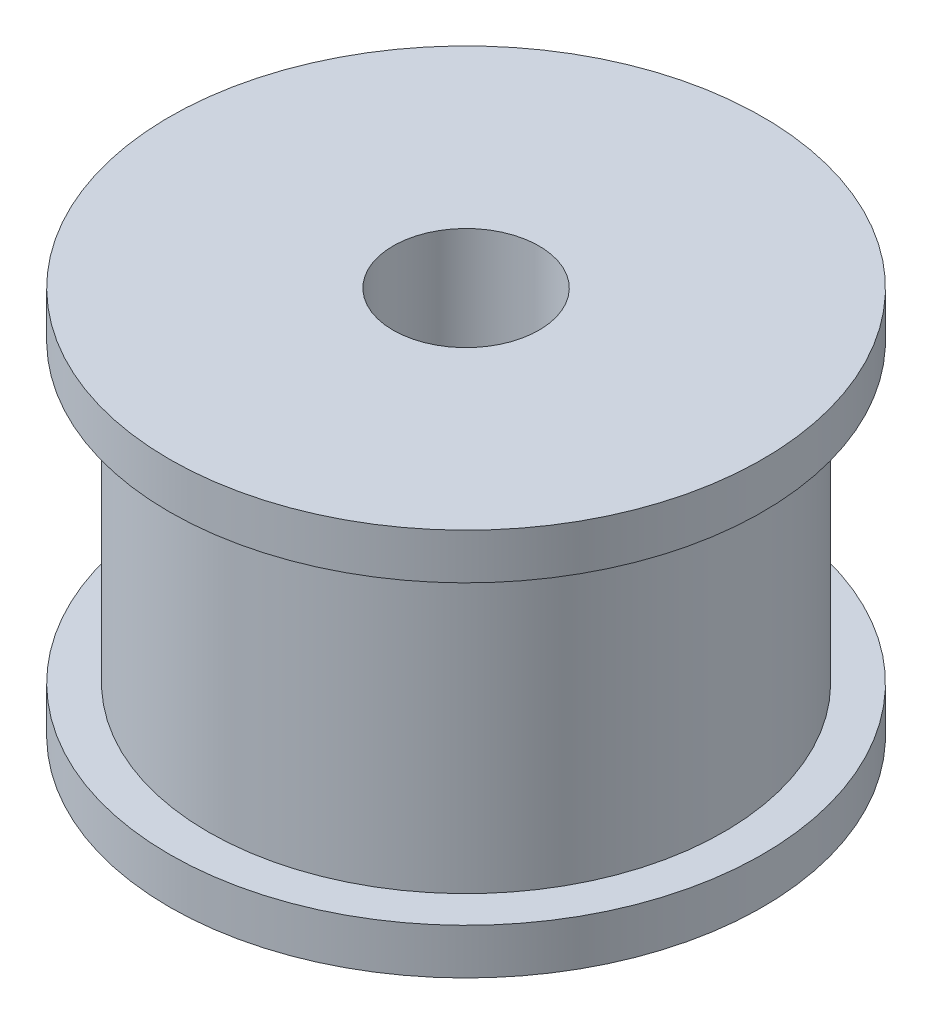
from build123d import *

# Parameters (mm, degrees)
SKETCH_2_R          = 1.6
CUT_EXTRUDE_1_DEPTH = 10


with BuildPart() as part:
    # Sketch 1 → Revolve 3 (revolve)
    with BuildSketch(Plane.XY, mode=Mode.PRIVATE) as revolve_3_sk:
        Polygon((-5.65, -3.25), (-5.65, 3.25), (-6.5, 3.25), (-6.5, 4.25), (0, 4.25), (0, -4.25), (-6.5, -4.25), (-6.5, -3.25), align=None)
    revolve(revolve_3_sk.sketch.rotate(Axis((0, 50, 0), (0, -1, 0)), 270), axis=Axis((0, 50, 0), (0, -1, 0)))

    # Sketch 2 → Cut-Extrude 1 (cut)
    with BuildSketch(Plane(origin=(0, 4.25, 0), x_dir=(1, 0, 0), z_dir=(0, 1, 0))):
        with Locations(Location((0, 0, 0), (0, 0, 270))):
            Circle(SKETCH_2_R)
    extrude(amount=-CUT_EXTRUDE_1_DEPTH, mode=Mode.SUBTRACT)


solid = part.part
